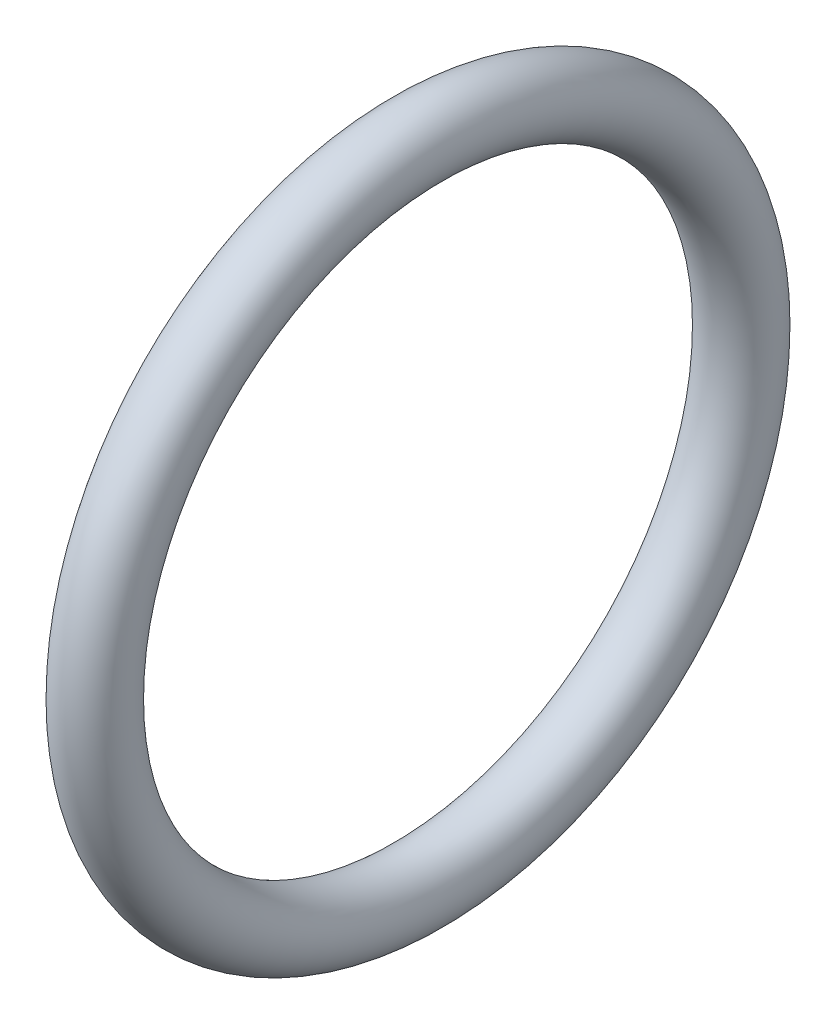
from build123d import *

# Parameters (mm, degrees)
SKETCH1_R = 1.3081


with BuildPart() as part:
    # Sketch1 → Base-Revolve (revolve)
    with BuildSketch(Plane.XY, mode=Mode.PRIVATE) as base_revolve_sk:
        with Locations((0, 12.2555)):
            Circle(SKETCH1_R)
    revolve(base_revolve_sk.sketch.rotate(Axis((0, 0, 0), (1, 0, 0)), 90), axis=Axis((0, 0, 0), (1, 0, 0)))


solid = part.part
